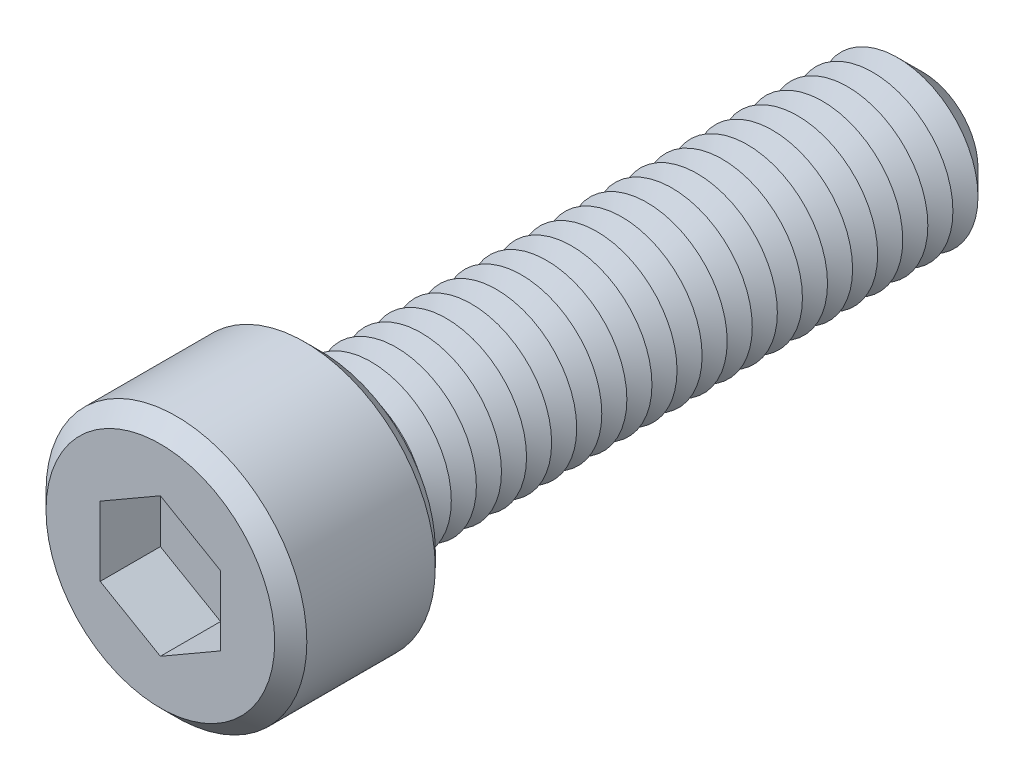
ISO-10303-21;
HEADER;
FILE_DESCRIPTION(('STEP AP214'),'2;1');
FILE_NAME('part.step','',(''),(''),'','','');
FILE_SCHEMA(('AUTOMOTIVE_DESIGN { 1 0 10303 214 1 1 1 1 }'));
ENDSEC;
DATA;
#1=APPLICATION_CONTEXT('core data for automotive mechanical design processes');
#2=APPLICATION_PROTOCOL_DEFINITION('international standard','automotive_design',2000,#1);
#3=PRODUCT_CONTEXT('',#1,'mechanical');
#4=PRODUCT('Part','Part','',(#3));
#5=PRODUCT_RELATED_PRODUCT_CATEGORY('part','',(#4));
#6=PRODUCT_DEFINITION_FORMATION('','',#4);
#7=PRODUCT_DEFINITION_CONTEXT('part definition',#1,'design');
#8=PRODUCT_DEFINITION('design','',#6,#7);
#9=PRODUCT_DEFINITION_SHAPE('','',#8);
#10=(LENGTH_UNIT() NAMED_UNIT(*) SI_UNIT(.MILLI.,.METRE.));
#11=(NAMED_UNIT(*) PLANE_ANGLE_UNIT() SI_UNIT($,.RADIAN.));
#12=(NAMED_UNIT(*) SI_UNIT($,.STERADIAN.) SOLID_ANGLE_UNIT());
#13=UNCERTAINTY_MEASURE_WITH_UNIT(LENGTH_MEASURE(1.E-05),#10,'distance_accuracy_value','');
#14=(GEOMETRIC_REPRESENTATION_CONTEXT(3) GLOBAL_UNCERTAINTY_ASSIGNED_CONTEXT((#13)) GLOBAL_UNIT_ASSIGNED_CONTEXT((#10,
#11,#12)) REPRESENTATION_CONTEXT('',''));
#15=CARTESIAN_POINT('',(0.,0.,0.));
#16=DIRECTION('',(0.,0.,1.));
#17=DIRECTION('',(1.,0.,0.));
#18=AXIS2_PLACEMENT_3D('',#15,#16,#17);
#19=CARTESIAN_POINT('',(0.,0.,8.));
#20=DIRECTION('',(0.,0.,-1.));
#21=DIRECTION('',(-1.,0.,0.));
#22=AXIS2_PLACEMENT_3D('',#19,#20,#21);
#23=CYLINDRICAL_SURFACE('',#22,6.5);
#24=CARTESIAN_POINT('',(0.,0.,0.800000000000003));
#25=DIRECTION('',(0.,0.,1.));
#26=DIRECTION('',(1.,0.,0.));
#27=AXIS2_PLACEMENT_3D('',#24,#25,#26);
#28=CIRCLE('',#27,6.5);
#29=CARTESIAN_POINT('',(6.5,0.,0.800000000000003));
#30=VERTEX_POINT('',#29);
#31=EDGE_CURVE('E360',#30,#30,#28,.T.);
#32=ORIENTED_EDGE('',*,*,#31,.T.);
#33=EDGE_LOOP('',(#32));
#34=FACE_BOUND('',#33,.T.);
#35=CARTESIAN_POINT('',(0.,0.,7.2));
#36=DIRECTION('',(0.,0.,1.));
#37=DIRECTION('',(1.,0.,0.));
#38=AXIS2_PLACEMENT_3D('',#35,#36,#37);
#39=CIRCLE('',#38,6.5);
#40=CARTESIAN_POINT('',(6.5,0.,7.2));
#41=VERTEX_POINT('',#40);
#42=EDGE_CURVE('E356',#41,#41,#39,.F.);
#43=ORIENTED_EDGE('',*,*,#42,.T.);
#44=EDGE_LOOP('',(#43));
#45=FACE_BOUND('',#44,.T.);
#46=ADVANCED_FACE('F39',(#34,#45),#23,.T.);
#47=CARTESIAN_POINT('',(0.,0.,8.));
#48=DIRECTION('',(0.,0.,1.));
#49=DIRECTION('',(1.,0.,0.));
#50=AXIS2_PLACEMENT_3D('',#47,#48,#49);
#51=PLANE('',#50);
#52=CARTESIAN_POINT('',(0.,0.,8.));
#53=DIRECTION('',(0.,0.,1.));
#54=DIRECTION('',(1.,0.,0.));
#55=AXIS2_PLACEMENT_3D('',#52,#53,#54);
#56=CIRCLE('',#55,5.70000000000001);
#57=CARTESIAN_POINT('',(5.70000000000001,0.,8.));
#58=VERTEX_POINT('',#57);
#59=EDGE_CURVE('E11',#58,#58,#56,.T.);
#60=ORIENTED_EDGE('',*,*,#59,.T.);
#61=EDGE_LOOP('',(#60));
#62=FACE_BOUND('',#61,.T.);
#63=DIRECTION('',(-0.866025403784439,0.5,0.));
#64=VECTOR('',#63,1.);
#65=CARTESIAN_POINT('',(3.,1.73205080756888,8.));
#66=LINE('',#65,#64);
#67=CARTESIAN_POINT('',(3.,1.73205080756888,8.));
#68=VERTEX_POINT('',#67);
#69=CARTESIAN_POINT('',(0.,3.46410161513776,8.));
#70=VERTEX_POINT('',#69);
#71=EDGE_CURVE('E55',#68,#70,#66,.T.);
#72=ORIENTED_EDGE('',*,*,#71,.F.);
#73=DIRECTION('',(0.,1.,0.));
#74=VECTOR('',#73,1.);
#75=CARTESIAN_POINT('',(3.,-1.73205080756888,8.));
#76=LINE('',#75,#74);
#77=CARTESIAN_POINT('',(3.,-1.73205080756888,8.));
#78=VERTEX_POINT('',#77);
#79=EDGE_CURVE('E151',#78,#68,#76,.T.);
#80=ORIENTED_EDGE('',*,*,#79,.F.);
#81=DIRECTION('',(0.866025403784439,0.5,0.));
#82=VECTOR('',#81,1.);
#83=CARTESIAN_POINT('',(0.,-3.46410161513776,8.));
#84=LINE('',#83,#82);
#85=CARTESIAN_POINT('',(0.,-3.46410161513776,8.));
#86=VERTEX_POINT('',#85);
#87=EDGE_CURVE('E148',#86,#78,#84,.T.);
#88=ORIENTED_EDGE('',*,*,#87,.F.);
#89=DIRECTION('',(0.866025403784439,-0.5,0.));
#90=VECTOR('',#89,1.);
#91=CARTESIAN_POINT('',(-3.,-1.73205080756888,8.));
#92=LINE('',#91,#90);
#93=CARTESIAN_POINT('',(-3.,-1.73205080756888,8.));
#94=VERTEX_POINT('',#93);
#95=EDGE_CURVE('E103',#94,#86,#92,.T.);
#96=ORIENTED_EDGE('',*,*,#95,.F.);
#97=DIRECTION('',(0.,-1.,0.));
#98=VECTOR('',#97,1.);
#99=CARTESIAN_POINT('',(-3.,1.73205080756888,8.));
#100=LINE('',#99,#98);
#101=CARTESIAN_POINT('',(-3.,1.73205080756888,8.));
#102=VERTEX_POINT('',#101);
#103=EDGE_CURVE('E142',#102,#94,#100,.T.);
#104=ORIENTED_EDGE('',*,*,#103,.F.);
#105=DIRECTION('',(-0.866025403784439,-0.5,0.));
#106=VECTOR('',#105,1.);
#107=CARTESIAN_POINT('',(0.,3.46410161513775,8.));
#108=LINE('',#107,#106);
#109=EDGE_CURVE('E137',#70,#102,#108,.T.);
#110=ORIENTED_EDGE('',*,*,#109,.F.);
#111=EDGE_LOOP('',(#72,#80,#88,#96,#104,#110));
#112=FACE_BOUND('',#111,.T.);
#113=ADVANCED_FACE('F379',(#62,#112),#51,.T.);
#114=CARTESIAN_POINT('',(0.,0.,0.));
#115=DIRECTION('',(0.,0.,1.));
#116=DIRECTION('',(1.,0.,0.));
#117=AXIS2_PLACEMENT_3D('',#114,#115,#116);
#118=PLANE('',#117);
#119=CARTESIAN_POINT('',(0.,0.,0.));
#120=DIRECTION('',(0.,0.,1.));
#121=DIRECTION('',(1.,0.,0.));
#122=AXIS2_PLACEMENT_3D('',#119,#120,#121);
#123=CIRCLE('',#122,5.69999999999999);
#124=CARTESIAN_POINT('',(5.69999999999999,0.,0.));
#125=VERTEX_POINT('',#124);
#126=EDGE_CURVE('E48',#125,#125,#123,.F.);
#127=ORIENTED_EDGE('',*,*,#126,.T.);
#128=EDGE_LOOP('',(#127));
#129=FACE_BOUND('',#128,.T.);
#130=CARTESIAN_POINT('',(0.,0.,0.));
#131=DIRECTION('',(0.,0.,1.));
#132=DIRECTION('',(1.,0.,0.));
#133=AXIS2_PLACEMENT_3D('',#130,#131,#132);
#134=CIRCLE('',#133,4.);
#135=CARTESIAN_POINT('',(4.,0.,0.));
#136=VERTEX_POINT('',#135);
#137=EDGE_CURVE('E348',#136,#136,#134,.T.);
#138=ORIENTED_EDGE('',*,*,#137,.T.);
#139=EDGE_LOOP('',(#138));
#140=FACE_BOUND('',#139,.T.);
#141=ADVANCED_FACE('F368',(#129,#140),#118,.F.);
#142=CARTESIAN_POINT('',(0.,0.,0.));
#143=DIRECTION('',(0.,0.,1.));
#144=DIRECTION('',(1.,0.,0.));
#145=AXIS2_PLACEMENT_3D('',#142,#143,#144);
#146=CONICAL_SURFACE('',#145,4.,1.0471975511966);
#147=CARTESIAN_POINT('',(0.,0.,-0.625000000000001));
#148=DIRECTION('',(0.,0.,1.));
#149=DIRECTION('',(1.,0.,0.));
#150=AXIS2_PLACEMENT_3D('',#147,#148,#149);
#151=CIRCLE('',#150,2.91746824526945);
#152=CARTESIAN_POINT('',(2.91746824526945,0.,-0.625000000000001));
#153=VERTEX_POINT('',#152);
#154=EDGE_CURVE('E344',#153,#153,#151,.T.);
#155=ORIENTED_EDGE('',*,*,#154,.T.);
#156=EDGE_LOOP('',(#155));
#157=FACE_BOUND('',#156,.T.);
#158=ORIENTED_EDGE('',*,*,#137,.F.);
#159=EDGE_LOOP('',(#158));
#160=FACE_BOUND('',#159,.T.);
#161=ADVANCED_FACE('F612',(#157,#160),#146,.T.);
#162=CARTESIAN_POINT('',(0.,0.,-0.625000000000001));
#163=DIRECTION('',(0.,0.,-1.));
#164=DIRECTION('',(-1.,0.,0.));
#165=AXIS2_PLACEMENT_3D('',#162,#163,#164);
#166=CONICAL_SURFACE('',#165,2.91746824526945,1.0471975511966);
#167=CARTESIAN_POINT('',(0.,0.,-1.25));
#168=DIRECTION('',(0.,0.,1.));
#169=DIRECTION('',(1.,0.,0.));
#170=AXIS2_PLACEMENT_3D('',#167,#168,#169);
#171=CIRCLE('',#170,4.);
#172=CARTESIAN_POINT('',(4.,0.,-1.25));
#173=VERTEX_POINT('',#172);
#174=EDGE_CURVE('E340',#173,#173,#171,.T.);
#175=ORIENTED_EDGE('',*,*,#174,.T.);
#176=EDGE_LOOP('',(#175));
#177=FACE_BOUND('',#176,.T.);
#178=ORIENTED_EDGE('',*,*,#154,.F.);
#179=EDGE_LOOP('',(#178));
#180=FACE_BOUND('',#179,.T.);
#181=ADVANCED_FACE('F608',(#177,#180),#166,.T.);
#182=CARTESIAN_POINT('',(0.,0.,-1.25));
#183=DIRECTION('',(0.,0.,1.));
#184=DIRECTION('',(1.,0.,0.));
#185=AXIS2_PLACEMENT_3D('',#182,#183,#184);
#186=CONICAL_SURFACE('',#185,4.,1.0471975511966);
#187=CARTESIAN_POINT('',(0.,0.,-1.875));
#188=DIRECTION('',(0.,0.,1.));
#189=DIRECTION('',(1.,0.,0.));
#190=AXIS2_PLACEMENT_3D('',#187,#188,#189);
#191=CIRCLE('',#190,2.91746824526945);
#192=CARTESIAN_POINT('',(2.91746824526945,0.,-1.875));
#193=VERTEX_POINT('',#192);
#194=EDGE_CURVE('E336',#193,#193,#191,.T.);
#195=ORIENTED_EDGE('',*,*,#194,.T.);
#196=EDGE_LOOP('',(#195));
#197=FACE_BOUND('',#196,.T.);
#198=ORIENTED_EDGE('',*,*,#174,.F.);
#199=EDGE_LOOP('',(#198));
#200=FACE_BOUND('',#199,.T.);
#201=ADVANCED_FACE('F604',(#197,#200),#186,.T.);
#202=CARTESIAN_POINT('',(0.,0.,-1.875));
#203=DIRECTION('',(0.,0.,-1.));
#204=DIRECTION('',(-1.,0.,0.));
#205=AXIS2_PLACEMENT_3D('',#202,#203,#204);
#206=CONICAL_SURFACE('',#205,2.91746824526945,1.0471975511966);
#207=CARTESIAN_POINT('',(0.,0.,-2.5));
#208=DIRECTION('',(0.,0.,1.));
#209=DIRECTION('',(1.,0.,0.));
#210=AXIS2_PLACEMENT_3D('',#207,#208,#209);
#211=CIRCLE('',#210,4.);
#212=CARTESIAN_POINT('',(4.,0.,-2.5));
#213=VERTEX_POINT('',#212);
#214=EDGE_CURVE('E332',#213,#213,#211,.T.);
#215=ORIENTED_EDGE('',*,*,#214,.T.);
#216=EDGE_LOOP('',(#215));
#217=FACE_BOUND('',#216,.T.);
#218=ORIENTED_EDGE('',*,*,#194,.F.);
#219=EDGE_LOOP('',(#218));
#220=FACE_BOUND('',#219,.T.);
#221=ADVANCED_FACE('F600',(#217,#220),#206,.T.);
#222=CARTESIAN_POINT('',(0.,0.,-2.5));
#223=DIRECTION('',(0.,0.,1.));
#224=DIRECTION('',(1.,0.,0.));
#225=AXIS2_PLACEMENT_3D('',#222,#223,#224);
#226=CONICAL_SURFACE('',#225,4.,1.0471975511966);
#227=CARTESIAN_POINT('',(0.,0.,-3.125));
#228=DIRECTION('',(0.,0.,1.));
#229=DIRECTION('',(1.,0.,0.));
#230=AXIS2_PLACEMENT_3D('',#227,#228,#229);
#231=CIRCLE('',#230,2.91746824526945);
#232=CARTESIAN_POINT('',(2.91746824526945,0.,-3.125));
#233=VERTEX_POINT('',#232);
#234=EDGE_CURVE('E328',#233,#233,#231,.T.);
#235=ORIENTED_EDGE('',*,*,#234,.T.);
#236=EDGE_LOOP('',(#235));
#237=FACE_BOUND('',#236,.T.);
#238=ORIENTED_EDGE('',*,*,#214,.F.);
#239=EDGE_LOOP('',(#238));
#240=FACE_BOUND('',#239,.T.);
#241=ADVANCED_FACE('F596',(#237,#240),#226,.T.);
#242=CARTESIAN_POINT('',(0.,0.,-3.125));
#243=DIRECTION('',(0.,0.,-1.));
#244=DIRECTION('',(-1.,0.,0.));
#245=AXIS2_PLACEMENT_3D('',#242,#243,#244);
#246=CONICAL_SURFACE('',#245,2.91746824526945,1.0471975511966);
#247=CARTESIAN_POINT('',(0.,0.,-3.75));
#248=DIRECTION('',(0.,0.,1.));
#249=DIRECTION('',(1.,0.,0.));
#250=AXIS2_PLACEMENT_3D('',#247,#248,#249);
#251=CIRCLE('',#250,4.);
#252=CARTESIAN_POINT('',(4.,0.,-3.75));
#253=VERTEX_POINT('',#252);
#254=EDGE_CURVE('E324',#253,#253,#251,.T.);
#255=ORIENTED_EDGE('',*,*,#254,.T.);
#256=EDGE_LOOP('',(#255));
#257=FACE_BOUND('',#256,.T.);
#258=ORIENTED_EDGE('',*,*,#234,.F.);
#259=EDGE_LOOP('',(#258));
#260=FACE_BOUND('',#259,.T.);
#261=ADVANCED_FACE('F592',(#257,#260),#246,.T.);
#262=CARTESIAN_POINT('',(0.,0.,-3.75));
#263=DIRECTION('',(0.,0.,1.));
#264=DIRECTION('',(1.,0.,0.));
#265=AXIS2_PLACEMENT_3D('',#262,#263,#264);
#266=CONICAL_SURFACE('',#265,4.,1.0471975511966);
#267=CARTESIAN_POINT('',(0.,0.,-4.375));
#268=DIRECTION('',(0.,0.,1.));
#269=DIRECTION('',(1.,0.,0.));
#270=AXIS2_PLACEMENT_3D('',#267,#268,#269);
#271=CIRCLE('',#270,2.91746824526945);
#272=CARTESIAN_POINT('',(2.91746824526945,0.,-4.375));
#273=VERTEX_POINT('',#272);
#274=EDGE_CURVE('E320',#273,#273,#271,.T.);
#275=ORIENTED_EDGE('',*,*,#274,.T.);
#276=EDGE_LOOP('',(#275));
#277=FACE_BOUND('',#276,.T.);
#278=ORIENTED_EDGE('',*,*,#254,.F.);
#279=EDGE_LOOP('',(#278));
#280=FACE_BOUND('',#279,.T.);
#281=ADVANCED_FACE('F588',(#277,#280),#266,.T.);
#282=CARTESIAN_POINT('',(0.,0.,-4.375));
#283=DIRECTION('',(0.,0.,-1.));
#284=DIRECTION('',(-1.,0.,0.));
#285=AXIS2_PLACEMENT_3D('',#282,#283,#284);
#286=CONICAL_SURFACE('',#285,2.91746824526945,1.0471975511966);
#287=CARTESIAN_POINT('',(0.,0.,-5.));
#288=DIRECTION('',(0.,0.,1.));
#289=DIRECTION('',(1.,0.,0.));
#290=AXIS2_PLACEMENT_3D('',#287,#288,#289);
#291=CIRCLE('',#290,4.);
#292=CARTESIAN_POINT('',(4.,0.,-5.));
#293=VERTEX_POINT('',#292);
#294=EDGE_CURVE('E316',#293,#293,#291,.T.);
#295=ORIENTED_EDGE('',*,*,#294,.T.);
#296=EDGE_LOOP('',(#295));
#297=FACE_BOUND('',#296,.T.);
#298=ORIENTED_EDGE('',*,*,#274,.F.);
#299=EDGE_LOOP('',(#298));
#300=FACE_BOUND('',#299,.T.);
#301=ADVANCED_FACE('F584',(#297,#300),#286,.T.);
#302=CARTESIAN_POINT('',(0.,0.,-5.));
#303=DIRECTION('',(0.,0.,1.));
#304=DIRECTION('',(1.,0.,0.));
#305=AXIS2_PLACEMENT_3D('',#302,#303,#304);
#306=CONICAL_SURFACE('',#305,4.,1.0471975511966);
#307=CARTESIAN_POINT('',(0.,0.,-5.625));
#308=DIRECTION('',(0.,0.,1.));
#309=DIRECTION('',(1.,0.,0.));
#310=AXIS2_PLACEMENT_3D('',#307,#308,#309);
#311=CIRCLE('',#310,2.91746824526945);
#312=CARTESIAN_POINT('',(2.91746824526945,0.,-5.625));
#313=VERTEX_POINT('',#312);
#314=EDGE_CURVE('E312',#313,#313,#311,.T.);
#315=ORIENTED_EDGE('',*,*,#314,.T.);
#316=EDGE_LOOP('',(#315));
#317=FACE_BOUND('',#316,.T.);
#318=ORIENTED_EDGE('',*,*,#294,.F.);
#319=EDGE_LOOP('',(#318));
#320=FACE_BOUND('',#319,.T.);
#321=ADVANCED_FACE('F580',(#317,#320),#306,.T.);
#322=CARTESIAN_POINT('',(0.,0.,-5.625));
#323=DIRECTION('',(0.,0.,-1.));
#324=DIRECTION('',(-1.,0.,0.));
#325=AXIS2_PLACEMENT_3D('',#322,#323,#324);
#326=CONICAL_SURFACE('',#325,2.91746824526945,1.0471975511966);
#327=CARTESIAN_POINT('',(0.,0.,-6.25));
#328=DIRECTION('',(0.,0.,1.));
#329=DIRECTION('',(1.,0.,0.));
#330=AXIS2_PLACEMENT_3D('',#327,#328,#329);
#331=CIRCLE('',#330,4.);
#332=CARTESIAN_POINT('',(4.,0.,-6.25));
#333=VERTEX_POINT('',#332);
#334=EDGE_CURVE('E308',#333,#333,#331,.T.);
#335=ORIENTED_EDGE('',*,*,#334,.T.);
#336=EDGE_LOOP('',(#335));
#337=FACE_BOUND('',#336,.T.);
#338=ORIENTED_EDGE('',*,*,#314,.F.);
#339=EDGE_LOOP('',(#338));
#340=FACE_BOUND('',#339,.T.);
#341=ADVANCED_FACE('F576',(#337,#340),#326,.T.);
#342=CARTESIAN_POINT('',(0.,0.,-6.25));
#343=DIRECTION('',(0.,0.,1.));
#344=DIRECTION('',(1.,0.,0.));
#345=AXIS2_PLACEMENT_3D('',#342,#343,#344);
#346=CONICAL_SURFACE('',#345,4.,1.0471975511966);
#347=CARTESIAN_POINT('',(0.,0.,-6.875));
#348=DIRECTION('',(0.,0.,1.));
#349=DIRECTION('',(1.,0.,0.));
#350=AXIS2_PLACEMENT_3D('',#347,#348,#349);
#351=CIRCLE('',#350,2.91746824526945);
#352=CARTESIAN_POINT('',(2.91746824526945,0.,-6.875));
#353=VERTEX_POINT('',#352);
#354=EDGE_CURVE('E304',#353,#353,#351,.T.);
#355=ORIENTED_EDGE('',*,*,#354,.T.);
#356=EDGE_LOOP('',(#355));
#357=FACE_BOUND('',#356,.T.);
#358=ORIENTED_EDGE('',*,*,#334,.F.);
#359=EDGE_LOOP('',(#358));
#360=FACE_BOUND('',#359,.T.);
#361=ADVANCED_FACE('F572',(#357,#360),#346,.T.);
#362=CARTESIAN_POINT('',(0.,0.,-6.875));
#363=DIRECTION('',(0.,0.,-1.));
#364=DIRECTION('',(-1.,0.,0.));
#365=AXIS2_PLACEMENT_3D('',#362,#363,#364);
#366=CONICAL_SURFACE('',#365,2.91746824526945,1.0471975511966);
#367=CARTESIAN_POINT('',(0.,0.,-7.5));
#368=DIRECTION('',(0.,0.,1.));
#369=DIRECTION('',(1.,0.,0.));
#370=AXIS2_PLACEMENT_3D('',#367,#368,#369);
#371=CIRCLE('',#370,4.);
#372=CARTESIAN_POINT('',(4.,0.,-7.5));
#373=VERTEX_POINT('',#372);
#374=EDGE_CURVE('E300',#373,#373,#371,.T.);
#375=ORIENTED_EDGE('',*,*,#374,.T.);
#376=EDGE_LOOP('',(#375));
#377=FACE_BOUND('',#376,.T.);
#378=ORIENTED_EDGE('',*,*,#354,.F.);
#379=EDGE_LOOP('',(#378));
#380=FACE_BOUND('',#379,.T.);
#381=ADVANCED_FACE('F568',(#377,#380),#366,.T.);
#382=CARTESIAN_POINT('',(0.,0.,-7.5));
#383=DIRECTION('',(0.,0.,1.));
#384=DIRECTION('',(1.,0.,0.));
#385=AXIS2_PLACEMENT_3D('',#382,#383,#384);
#386=CONICAL_SURFACE('',#385,4.,1.0471975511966);
#387=CARTESIAN_POINT('',(0.,0.,-8.125));
#388=DIRECTION('',(0.,0.,1.));
#389=DIRECTION('',(1.,0.,0.));
#390=AXIS2_PLACEMENT_3D('',#387,#388,#389);
#391=CIRCLE('',#390,2.91746824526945);
#392=CARTESIAN_POINT('',(2.91746824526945,0.,-8.125));
#393=VERTEX_POINT('',#392);
#394=EDGE_CURVE('E296',#393,#393,#391,.T.);
#395=ORIENTED_EDGE('',*,*,#394,.T.);
#396=EDGE_LOOP('',(#395));
#397=FACE_BOUND('',#396,.T.);
#398=ORIENTED_EDGE('',*,*,#374,.F.);
#399=EDGE_LOOP('',(#398));
#400=FACE_BOUND('',#399,.T.);
#401=ADVANCED_FACE('F564',(#397,#400),#386,.T.);
#402=CARTESIAN_POINT('',(0.,0.,-8.125));
#403=DIRECTION('',(0.,0.,-1.));
#404=DIRECTION('',(-1.,0.,0.));
#405=AXIS2_PLACEMENT_3D('',#402,#403,#404);
#406=CONICAL_SURFACE('',#405,2.91746824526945,1.0471975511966);
#407=CARTESIAN_POINT('',(0.,0.,-8.75));
#408=DIRECTION('',(0.,0.,1.));
#409=DIRECTION('',(1.,0.,0.));
#410=AXIS2_PLACEMENT_3D('',#407,#408,#409);
#411=CIRCLE('',#410,4.);
#412=CARTESIAN_POINT('',(4.,0.,-8.75));
#413=VERTEX_POINT('',#412);
#414=EDGE_CURVE('E292',#413,#413,#411,.T.);
#415=ORIENTED_EDGE('',*,*,#414,.T.);
#416=EDGE_LOOP('',(#415));
#417=FACE_BOUND('',#416,.T.);
#418=ORIENTED_EDGE('',*,*,#394,.F.);
#419=EDGE_LOOP('',(#418));
#420=FACE_BOUND('',#419,.T.);
#421=ADVANCED_FACE('F560',(#417,#420),#406,.T.);
#422=CARTESIAN_POINT('',(0.,0.,-8.75));
#423=DIRECTION('',(0.,0.,1.));
#424=DIRECTION('',(1.,0.,0.));
#425=AXIS2_PLACEMENT_3D('',#422,#423,#424);
#426=CONICAL_SURFACE('',#425,4.,1.0471975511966);
#427=CARTESIAN_POINT('',(0.,0.,-9.375));
#428=DIRECTION('',(0.,0.,1.));
#429=DIRECTION('',(1.,0.,0.));
#430=AXIS2_PLACEMENT_3D('',#427,#428,#429);
#431=CIRCLE('',#430,2.91746824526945);
#432=CARTESIAN_POINT('',(2.91746824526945,0.,-9.375));
#433=VERTEX_POINT('',#432);
#434=EDGE_CURVE('E289',#433,#433,#431,.T.);
#435=ORIENTED_EDGE('',*,*,#434,.T.);
#436=EDGE_LOOP('',(#435));
#437=FACE_BOUND('',#436,.T.);
#438=ORIENTED_EDGE('',*,*,#414,.F.);
#439=EDGE_LOOP('',(#438));
#440=FACE_BOUND('',#439,.T.);
#441=ADVANCED_FACE('F556',(#437,#440),#426,.T.);
#442=CARTESIAN_POINT('',(0.,0.,-9.375));
#443=DIRECTION('',(0.,0.,-1.));
#444=DIRECTION('',(-1.,0.,0.));
#445=AXIS2_PLACEMENT_3D('',#442,#443,#444);
#446=CONICAL_SURFACE('',#445,2.91746824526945,1.0471975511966);
#447=CARTESIAN_POINT('',(0.,0.,-10.));
#448=DIRECTION('',(0.,0.,1.));
#449=DIRECTION('',(1.,0.,0.));
#450=AXIS2_PLACEMENT_3D('',#447,#448,#449);
#451=CIRCLE('',#450,4.);
#452=CARTESIAN_POINT('',(4.,0.,-10.));
#453=VERTEX_POINT('',#452);
#454=EDGE_CURVE('E285',#453,#453,#451,.T.);
#455=ORIENTED_EDGE('',*,*,#454,.T.);
#456=EDGE_LOOP('',(#455));
#457=FACE_BOUND('',#456,.T.);
#458=ORIENTED_EDGE('',*,*,#434,.F.);
#459=EDGE_LOOP('',(#458));
#460=FACE_BOUND('',#459,.T.);
#461=ADVANCED_FACE('F552',(#457,#460),#446,.T.);
#462=CARTESIAN_POINT('',(0.,0.,-10.));
#463=DIRECTION('',(0.,0.,1.));
#464=DIRECTION('',(1.,0.,0.));
#465=AXIS2_PLACEMENT_3D('',#462,#463,#464);
#466=CONICAL_SURFACE('',#465,4.,1.0471975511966);
#467=CARTESIAN_POINT('',(0.,0.,-10.625));
#468=DIRECTION('',(0.,0.,1.));
#469=DIRECTION('',(1.,0.,0.));
#470=AXIS2_PLACEMENT_3D('',#467,#468,#469);
#471=CIRCLE('',#470,2.91746824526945);
#472=CARTESIAN_POINT('',(2.91746824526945,0.,-10.625));
#473=VERTEX_POINT('',#472);
#474=EDGE_CURVE('E281',#473,#473,#471,.T.);
#475=ORIENTED_EDGE('',*,*,#474,.T.);
#476=EDGE_LOOP('',(#475));
#477=FACE_BOUND('',#476,.T.);
#478=ORIENTED_EDGE('',*,*,#454,.F.);
#479=EDGE_LOOP('',(#478));
#480=FACE_BOUND('',#479,.T.);
#481=ADVANCED_FACE('F548',(#477,#480),#466,.T.);
#482=CARTESIAN_POINT('',(0.,0.,-10.625));
#483=DIRECTION('',(0.,0.,-1.));
#484=DIRECTION('',(-1.,0.,0.));
#485=AXIS2_PLACEMENT_3D('',#482,#483,#484);
#486=CONICAL_SURFACE('',#485,2.91746824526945,1.0471975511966);
#487=CARTESIAN_POINT('',(0.,0.,-11.25));
#488=DIRECTION('',(0.,0.,1.));
#489=DIRECTION('',(1.,0.,0.));
#490=AXIS2_PLACEMENT_3D('',#487,#488,#489);
#491=CIRCLE('',#490,4.);
#492=CARTESIAN_POINT('',(4.,0.,-11.25));
#493=VERTEX_POINT('',#492);
#494=EDGE_CURVE('E277',#493,#493,#491,.T.);
#495=ORIENTED_EDGE('',*,*,#494,.T.);
#496=EDGE_LOOP('',(#495));
#497=FACE_BOUND('',#496,.T.);
#498=ORIENTED_EDGE('',*,*,#474,.F.);
#499=EDGE_LOOP('',(#498));
#500=FACE_BOUND('',#499,.T.);
#501=ADVANCED_FACE('F544',(#497,#500),#486,.T.);
#502=CARTESIAN_POINT('',(0.,0.,-11.25));
#503=DIRECTION('',(0.,0.,1.));
#504=DIRECTION('',(1.,0.,0.));
#505=AXIS2_PLACEMENT_3D('',#502,#503,#504);
#506=CONICAL_SURFACE('',#505,4.,1.0471975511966);
#507=CARTESIAN_POINT('',(0.,0.,-11.875));
#508=DIRECTION('',(0.,0.,1.));
#509=DIRECTION('',(1.,0.,0.));
#510=AXIS2_PLACEMENT_3D('',#507,#508,#509);
#511=CIRCLE('',#510,2.91746824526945);
#512=CARTESIAN_POINT('',(2.91746824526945,0.,-11.875));
#513=VERTEX_POINT('',#512);
#514=EDGE_CURVE('E273',#513,#513,#511,.T.);
#515=ORIENTED_EDGE('',*,*,#514,.T.);
#516=EDGE_LOOP('',(#515));
#517=FACE_BOUND('',#516,.T.);
#518=ORIENTED_EDGE('',*,*,#494,.F.);
#519=EDGE_LOOP('',(#518));
#520=FACE_BOUND('',#519,.T.);
#521=ADVANCED_FACE('F540',(#517,#520),#506,.T.);
#522=CARTESIAN_POINT('',(0.,0.,-11.875));
#523=DIRECTION('',(0.,0.,-1.));
#524=DIRECTION('',(-1.,0.,0.));
#525=AXIS2_PLACEMENT_3D('',#522,#523,#524);
#526=CONICAL_SURFACE('',#525,2.91746824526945,1.0471975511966);
#527=CARTESIAN_POINT('',(0.,0.,-12.5));
#528=DIRECTION('',(0.,0.,1.));
#529=DIRECTION('',(1.,0.,0.));
#530=AXIS2_PLACEMENT_3D('',#527,#528,#529);
#531=CIRCLE('',#530,4.);
#532=CARTESIAN_POINT('',(4.,0.,-12.5));
#533=VERTEX_POINT('',#532);
#534=EDGE_CURVE('E269',#533,#533,#531,.T.);
#535=ORIENTED_EDGE('',*,*,#534,.T.);
#536=EDGE_LOOP('',(#535));
#537=FACE_BOUND('',#536,.T.);
#538=ORIENTED_EDGE('',*,*,#514,.F.);
#539=EDGE_LOOP('',(#538));
#540=FACE_BOUND('',#539,.T.);
#541=ADVANCED_FACE('F536',(#537,#540),#526,.T.);
#542=CARTESIAN_POINT('',(0.,0.,-12.5));
#543=DIRECTION('',(0.,0.,1.));
#544=DIRECTION('',(1.,0.,0.));
#545=AXIS2_PLACEMENT_3D('',#542,#543,#544);
#546=CONICAL_SURFACE('',#545,4.,1.0471975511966);
#547=CARTESIAN_POINT('',(0.,0.,-13.125));
#548=DIRECTION('',(0.,0.,1.));
#549=DIRECTION('',(1.,0.,0.));
#550=AXIS2_PLACEMENT_3D('',#547,#548,#549);
#551=CIRCLE('',#550,2.91746824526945);
#552=CARTESIAN_POINT('',(2.91746824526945,0.,-13.125));
#553=VERTEX_POINT('',#552);
#554=EDGE_CURVE('E265',#553,#553,#551,.T.);
#555=ORIENTED_EDGE('',*,*,#554,.T.);
#556=EDGE_LOOP('',(#555));
#557=FACE_BOUND('',#556,.T.);
#558=ORIENTED_EDGE('',*,*,#534,.F.);
#559=EDGE_LOOP('',(#558));
#560=FACE_BOUND('',#559,.T.);
#561=ADVANCED_FACE('F532',(#557,#560),#546,.T.);
#562=CARTESIAN_POINT('',(0.,0.,-13.125));
#563=DIRECTION('',(0.,0.,-1.));
#564=DIRECTION('',(-1.,0.,0.));
#565=AXIS2_PLACEMENT_3D('',#562,#563,#564);
#566=CONICAL_SURFACE('',#565,2.91746824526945,1.0471975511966);
#567=CARTESIAN_POINT('',(0.,0.,-13.75));
#568=DIRECTION('',(0.,0.,1.));
#569=DIRECTION('',(1.,0.,0.));
#570=AXIS2_PLACEMENT_3D('',#567,#568,#569);
#571=CIRCLE('',#570,4.);
#572=CARTESIAN_POINT('',(4.,0.,-13.75));
#573=VERTEX_POINT('',#572);
#574=EDGE_CURVE('E261',#573,#573,#571,.T.);
#575=ORIENTED_EDGE('',*,*,#574,.T.);
#576=EDGE_LOOP('',(#575));
#577=FACE_BOUND('',#576,.T.);
#578=ORIENTED_EDGE('',*,*,#554,.F.);
#579=EDGE_LOOP('',(#578));
#580=FACE_BOUND('',#579,.T.);
#581=ADVANCED_FACE('F528',(#577,#580),#566,.T.);
#582=CARTESIAN_POINT('',(0.,0.,-13.75));
#583=DIRECTION('',(0.,0.,1.));
#584=DIRECTION('',(1.,0.,0.));
#585=AXIS2_PLACEMENT_3D('',#582,#583,#584);
#586=CONICAL_SURFACE('',#585,4.,1.0471975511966);
#587=CARTESIAN_POINT('',(0.,0.,-14.375));
#588=DIRECTION('',(0.,0.,1.));
#589=DIRECTION('',(1.,0.,0.));
#590=AXIS2_PLACEMENT_3D('',#587,#588,#589);
#591=CIRCLE('',#590,2.91746824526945);
#592=CARTESIAN_POINT('',(2.91746824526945,0.,-14.375));
#593=VERTEX_POINT('',#592);
#594=EDGE_CURVE('E257',#593,#593,#591,.T.);
#595=ORIENTED_EDGE('',*,*,#594,.T.);
#596=EDGE_LOOP('',(#595));
#597=FACE_BOUND('',#596,.T.);
#598=ORIENTED_EDGE('',*,*,#574,.F.);
#599=EDGE_LOOP('',(#598));
#600=FACE_BOUND('',#599,.T.);
#601=ADVANCED_FACE('F524',(#597,#600),#586,.T.);
#602=CARTESIAN_POINT('',(0.,0.,-14.375));
#603=DIRECTION('',(0.,0.,-1.));
#604=DIRECTION('',(-1.,0.,0.));
#605=AXIS2_PLACEMENT_3D('',#602,#603,#604);
#606=CONICAL_SURFACE('',#605,2.91746824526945,1.0471975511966);
#607=CARTESIAN_POINT('',(0.,0.,-15.));
#608=DIRECTION('',(0.,0.,1.));
#609=DIRECTION('',(1.,0.,0.));
#610=AXIS2_PLACEMENT_3D('',#607,#608,#609);
#611=CIRCLE('',#610,4.);
#612=CARTESIAN_POINT('',(4.,0.,-15.));
#613=VERTEX_POINT('',#612);
#614=EDGE_CURVE('E253',#613,#613,#611,.T.);
#615=ORIENTED_EDGE('',*,*,#614,.T.);
#616=EDGE_LOOP('',(#615));
#617=FACE_BOUND('',#616,.T.);
#618=ORIENTED_EDGE('',*,*,#594,.F.);
#619=EDGE_LOOP('',(#618));
#620=FACE_BOUND('',#619,.T.);
#621=ADVANCED_FACE('F520',(#617,#620),#606,.T.);
#622=CARTESIAN_POINT('',(0.,0.,-15.));
#623=DIRECTION('',(0.,0.,1.));
#624=DIRECTION('',(1.,0.,0.));
#625=AXIS2_PLACEMENT_3D('',#622,#623,#624);
#626=CONICAL_SURFACE('',#625,4.,1.0471975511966);
#627=CARTESIAN_POINT('',(0.,0.,-15.625));
#628=DIRECTION('',(0.,0.,1.));
#629=DIRECTION('',(1.,0.,0.));
#630=AXIS2_PLACEMENT_3D('',#627,#628,#629);
#631=CIRCLE('',#630,2.91746824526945);
#632=CARTESIAN_POINT('',(2.91746824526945,0.,-15.625));
#633=VERTEX_POINT('',#632);
#634=EDGE_CURVE('E249',#633,#633,#631,.T.);
#635=ORIENTED_EDGE('',*,*,#634,.T.);
#636=EDGE_LOOP('',(#635));
#637=FACE_BOUND('',#636,.T.);
#638=ORIENTED_EDGE('',*,*,#614,.F.);
#639=EDGE_LOOP('',(#638));
#640=FACE_BOUND('',#639,.T.);
#641=ADVANCED_FACE('F516',(#637,#640),#626,.T.);
#642=CARTESIAN_POINT('',(0.,0.,-15.625));
#643=DIRECTION('',(0.,0.,-1.));
#644=DIRECTION('',(-1.,0.,0.));
#645=AXIS2_PLACEMENT_3D('',#642,#643,#644);
#646=CONICAL_SURFACE('',#645,2.91746824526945,1.0471975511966);
#647=CARTESIAN_POINT('',(0.,0.,-16.25));
#648=DIRECTION('',(0.,0.,1.));
#649=DIRECTION('',(1.,0.,0.));
#650=AXIS2_PLACEMENT_3D('',#647,#648,#649);
#651=CIRCLE('',#650,4.);
#652=CARTESIAN_POINT('',(4.,0.,-16.25));
#653=VERTEX_POINT('',#652);
#654=EDGE_CURVE('E245',#653,#653,#651,.T.);
#655=ORIENTED_EDGE('',*,*,#654,.T.);
#656=EDGE_LOOP('',(#655));
#657=FACE_BOUND('',#656,.T.);
#658=ORIENTED_EDGE('',*,*,#634,.F.);
#659=EDGE_LOOP('',(#658));
#660=FACE_BOUND('',#659,.T.);
#661=ADVANCED_FACE('F512',(#657,#660),#646,.T.);
#662=CARTESIAN_POINT('',(0.,0.,-16.25));
#663=DIRECTION('',(0.,0.,1.));
#664=DIRECTION('',(1.,0.,0.));
#665=AXIS2_PLACEMENT_3D('',#662,#663,#664);
#666=CONICAL_SURFACE('',#665,4.,1.0471975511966);
#667=CARTESIAN_POINT('',(0.,0.,-16.875));
#668=DIRECTION('',(0.,0.,1.));
#669=DIRECTION('',(1.,0.,0.));
#670=AXIS2_PLACEMENT_3D('',#667,#668,#669);
#671=CIRCLE('',#670,2.91746824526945);
#672=CARTESIAN_POINT('',(2.91746824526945,0.,-16.875));
#673=VERTEX_POINT('',#672);
#674=EDGE_CURVE('E241',#673,#673,#671,.T.);
#675=ORIENTED_EDGE('',*,*,#674,.T.);
#676=EDGE_LOOP('',(#675));
#677=FACE_BOUND('',#676,.T.);
#678=ORIENTED_EDGE('',*,*,#654,.F.);
#679=EDGE_LOOP('',(#678));
#680=FACE_BOUND('',#679,.T.);
#681=ADVANCED_FACE('F508',(#677,#680),#666,.T.);
#682=CARTESIAN_POINT('',(0.,0.,-16.875));
#683=DIRECTION('',(0.,0.,-1.));
#684=DIRECTION('',(-1.,0.,0.));
#685=AXIS2_PLACEMENT_3D('',#682,#683,#684);
#686=CONICAL_SURFACE('',#685,2.91746824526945,1.0471975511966);
#687=CARTESIAN_POINT('',(0.,0.,-17.5));
#688=DIRECTION('',(0.,0.,1.));
#689=DIRECTION('',(1.,0.,0.));
#690=AXIS2_PLACEMENT_3D('',#687,#688,#689);
#691=CIRCLE('',#690,4.);
#692=CARTESIAN_POINT('',(4.,0.,-17.5));
#693=VERTEX_POINT('',#692);
#694=EDGE_CURVE('E237',#693,#693,#691,.T.);
#695=ORIENTED_EDGE('',*,*,#694,.T.);
#696=EDGE_LOOP('',(#695));
#697=FACE_BOUND('',#696,.T.);
#698=ORIENTED_EDGE('',*,*,#674,.F.);
#699=EDGE_LOOP('',(#698));
#700=FACE_BOUND('',#699,.T.);
#701=ADVANCED_FACE('F504',(#697,#700),#686,.T.);
#702=CARTESIAN_POINT('',(0.,0.,-17.5));
#703=DIRECTION('',(0.,0.,1.));
#704=DIRECTION('',(1.,0.,0.));
#705=AXIS2_PLACEMENT_3D('',#702,#703,#704);
#706=CONICAL_SURFACE('',#705,4.,1.0471975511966);
#707=CARTESIAN_POINT('',(0.,0.,-18.125));
#708=DIRECTION('',(0.,0.,1.));
#709=DIRECTION('',(1.,0.,0.));
#710=AXIS2_PLACEMENT_3D('',#707,#708,#709);
#711=CIRCLE('',#710,2.91746824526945);
#712=CARTESIAN_POINT('',(2.91746824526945,0.,-18.125));
#713=VERTEX_POINT('',#712);
#714=EDGE_CURVE('E233',#713,#713,#711,.T.);
#715=ORIENTED_EDGE('',*,*,#714,.T.);
#716=EDGE_LOOP('',(#715));
#717=FACE_BOUND('',#716,.T.);
#718=ORIENTED_EDGE('',*,*,#694,.F.);
#719=EDGE_LOOP('',(#718));
#720=FACE_BOUND('',#719,.T.);
#721=ADVANCED_FACE('F500',(#717,#720),#706,.T.);
#722=CARTESIAN_POINT('',(0.,0.,-18.125));
#723=DIRECTION('',(0.,0.,-1.));
#724=DIRECTION('',(-1.,0.,0.));
#725=AXIS2_PLACEMENT_3D('',#722,#723,#724);
#726=CONICAL_SURFACE('',#725,2.91746824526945,1.0471975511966);
#727=CARTESIAN_POINT('',(0.,0.,-18.75));
#728=DIRECTION('',(0.,0.,1.));
#729=DIRECTION('',(1.,0.,0.));
#730=AXIS2_PLACEMENT_3D('',#727,#728,#729);
#731=CIRCLE('',#730,4.);
#732=CARTESIAN_POINT('',(4.,0.,-18.75));
#733=VERTEX_POINT('',#732);
#734=EDGE_CURVE('E229',#733,#733,#731,.T.);
#735=ORIENTED_EDGE('',*,*,#734,.T.);
#736=EDGE_LOOP('',(#735));
#737=FACE_BOUND('',#736,.T.);
#738=ORIENTED_EDGE('',*,*,#714,.F.);
#739=EDGE_LOOP('',(#738));
#740=FACE_BOUND('',#739,.T.);
#741=ADVANCED_FACE('F496',(#737,#740),#726,.T.);
#742=CARTESIAN_POINT('',(0.,0.,-18.75));
#743=DIRECTION('',(0.,0.,1.));
#744=DIRECTION('',(1.,0.,0.));
#745=AXIS2_PLACEMENT_3D('',#742,#743,#744);
#746=CONICAL_SURFACE('',#745,4.,1.0471975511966);
#747=CARTESIAN_POINT('',(0.,0.,-19.375));
#748=DIRECTION('',(0.,0.,1.));
#749=DIRECTION('',(1.,0.,0.));
#750=AXIS2_PLACEMENT_3D('',#747,#748,#749);
#751=CIRCLE('',#750,2.91746824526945);
#752=CARTESIAN_POINT('',(2.91746824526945,0.,-19.375));
#753=VERTEX_POINT('',#752);
#754=EDGE_CURVE('E225',#753,#753,#751,.T.);
#755=ORIENTED_EDGE('',*,*,#754,.T.);
#756=EDGE_LOOP('',(#755));
#757=FACE_BOUND('',#756,.T.);
#758=ORIENTED_EDGE('',*,*,#734,.F.);
#759=EDGE_LOOP('',(#758));
#760=FACE_BOUND('',#759,.T.);
#761=ADVANCED_FACE('F492',(#757,#760),#746,.T.);
#762=CARTESIAN_POINT('',(0.,0.,-19.375));
#763=DIRECTION('',(0.,0.,-1.));
#764=DIRECTION('',(-1.,0.,0.));
#765=AXIS2_PLACEMENT_3D('',#762,#763,#764);
#766=CONICAL_SURFACE('',#765,2.91746824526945,1.0471975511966);
#767=CARTESIAN_POINT('',(0.,0.,-20.));
#768=DIRECTION('',(0.,0.,1.));
#769=DIRECTION('',(1.,0.,0.));
#770=AXIS2_PLACEMENT_3D('',#767,#768,#769);
#771=CIRCLE('',#770,4.);
#772=CARTESIAN_POINT('',(4.,0.,-20.));
#773=VERTEX_POINT('',#772);
#774=EDGE_CURVE('E221',#773,#773,#771,.T.);
#775=ORIENTED_EDGE('',*,*,#774,.T.);
#776=EDGE_LOOP('',(#775));
#777=FACE_BOUND('',#776,.T.);
#778=ORIENTED_EDGE('',*,*,#754,.F.);
#779=EDGE_LOOP('',(#778));
#780=FACE_BOUND('',#779,.T.);
#781=ADVANCED_FACE('F488',(#777,#780),#766,.T.);
#782=CARTESIAN_POINT('',(0.,0.,-20.));
#783=DIRECTION('',(0.,0.,1.));
#784=DIRECTION('',(1.,0.,0.));
#785=AXIS2_PLACEMENT_3D('',#782,#783,#784);
#786=CONICAL_SURFACE('',#785,4.,1.0471975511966);
#787=CARTESIAN_POINT('',(0.,0.,-20.625));
#788=DIRECTION('',(0.,0.,1.));
#789=DIRECTION('',(1.,0.,0.));
#790=AXIS2_PLACEMENT_3D('',#787,#788,#789);
#791=CIRCLE('',#790,2.91746824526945);
#792=CARTESIAN_POINT('',(2.91746824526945,0.,-20.625));
#793=VERTEX_POINT('',#792);
#794=EDGE_CURVE('E217',#793,#793,#791,.T.);
#795=ORIENTED_EDGE('',*,*,#794,.T.);
#796=EDGE_LOOP('',(#795));
#797=FACE_BOUND('',#796,.T.);
#798=ORIENTED_EDGE('',*,*,#774,.F.);
#799=EDGE_LOOP('',(#798));
#800=FACE_BOUND('',#799,.T.);
#801=ADVANCED_FACE('F484',(#797,#800),#786,.T.);
#802=CARTESIAN_POINT('',(0.,0.,-20.625));
#803=DIRECTION('',(0.,0.,-1.));
#804=DIRECTION('',(-1.,0.,0.));
#805=AXIS2_PLACEMENT_3D('',#802,#803,#804);
#806=CONICAL_SURFACE('',#805,2.91746824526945,1.0471975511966);
#807=CARTESIAN_POINT('',(0.,0.,-21.25));
#808=DIRECTION('',(0.,0.,1.));
#809=DIRECTION('',(1.,0.,0.));
#810=AXIS2_PLACEMENT_3D('',#807,#808,#809);
#811=CIRCLE('',#810,4.);
#812=CARTESIAN_POINT('',(4.,0.,-21.25));
#813=VERTEX_POINT('',#812);
#814=EDGE_CURVE('E213',#813,#813,#811,.T.);
#815=ORIENTED_EDGE('',*,*,#814,.T.);
#816=EDGE_LOOP('',(#815));
#817=FACE_BOUND('',#816,.T.);
#818=ORIENTED_EDGE('',*,*,#794,.F.);
#819=EDGE_LOOP('',(#818));
#820=FACE_BOUND('',#819,.T.);
#821=ADVANCED_FACE('F480',(#817,#820),#806,.T.);
#822=CARTESIAN_POINT('',(0.,0.,-21.25));
#823=DIRECTION('',(0.,0.,1.));
#824=DIRECTION('',(1.,0.,0.));
#825=AXIS2_PLACEMENT_3D('',#822,#823,#824);
#826=CONICAL_SURFACE('',#825,4.,1.0471975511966);
#827=CARTESIAN_POINT('',(0.,0.,-21.875));
#828=DIRECTION('',(0.,0.,1.));
#829=DIRECTION('',(1.,0.,0.));
#830=AXIS2_PLACEMENT_3D('',#827,#828,#829);
#831=CIRCLE('',#830,2.91746824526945);
#832=CARTESIAN_POINT('',(2.91746824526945,0.,-21.875));
#833=VERTEX_POINT('',#832);
#834=EDGE_CURVE('E209',#833,#833,#831,.T.);
#835=ORIENTED_EDGE('',*,*,#834,.T.);
#836=EDGE_LOOP('',(#835));
#837=FACE_BOUND('',#836,.T.);
#838=ORIENTED_EDGE('',*,*,#814,.F.);
#839=EDGE_LOOP('',(#838));
#840=FACE_BOUND('',#839,.T.);
#841=ADVANCED_FACE('F476',(#837,#840),#826,.T.);
#842=CARTESIAN_POINT('',(0.,0.,-21.875));
#843=DIRECTION('',(0.,0.,-1.));
#844=DIRECTION('',(-1.,0.,0.));
#845=AXIS2_PLACEMENT_3D('',#842,#843,#844);
#846=CONICAL_SURFACE('',#845,2.91746824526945,1.0471975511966);
#847=CARTESIAN_POINT('',(0.,0.,-22.5));
#848=DIRECTION('',(0.,0.,1.));
#849=DIRECTION('',(1.,0.,0.));
#850=AXIS2_PLACEMENT_3D('',#847,#848,#849);
#851=CIRCLE('',#850,4.);
#852=CARTESIAN_POINT('',(4.,0.,-22.5));
#853=VERTEX_POINT('',#852);
#854=EDGE_CURVE('E205',#853,#853,#851,.T.);
#855=ORIENTED_EDGE('',*,*,#854,.T.);
#856=EDGE_LOOP('',(#855));
#857=FACE_BOUND('',#856,.T.);
#858=ORIENTED_EDGE('',*,*,#834,.F.);
#859=EDGE_LOOP('',(#858));
#860=FACE_BOUND('',#859,.T.);
#861=ADVANCED_FACE('F472',(#857,#860),#846,.T.);
#862=CARTESIAN_POINT('',(0.,0.,-22.5));
#863=DIRECTION('',(0.,0.,1.));
#864=DIRECTION('',(1.,0.,0.));
#865=AXIS2_PLACEMENT_3D('',#862,#863,#864);
#866=CONICAL_SURFACE('',#865,4.,1.0471975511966);
#867=CARTESIAN_POINT('',(0.,0.,-23.125));
#868=DIRECTION('',(0.,0.,1.));
#869=DIRECTION('',(1.,0.,0.));
#870=AXIS2_PLACEMENT_3D('',#867,#868,#869);
#871=CIRCLE('',#870,2.91746824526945);
#872=CARTESIAN_POINT('',(2.91746824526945,0.,-23.125));
#873=VERTEX_POINT('',#872);
#874=EDGE_CURVE('E201',#873,#873,#871,.T.);
#875=ORIENTED_EDGE('',*,*,#874,.T.);
#876=EDGE_LOOP('',(#875));
#877=FACE_BOUND('',#876,.T.);
#878=ORIENTED_EDGE('',*,*,#854,.F.);
#879=EDGE_LOOP('',(#878));
#880=FACE_BOUND('',#879,.T.);
#881=ADVANCED_FACE('F468',(#877,#880),#866,.T.);
#882=CARTESIAN_POINT('',(0.,0.,-23.125));
#883=DIRECTION('',(0.,0.,-1.));
#884=DIRECTION('',(-1.,0.,0.));
#885=AXIS2_PLACEMENT_3D('',#882,#883,#884);
#886=CONICAL_SURFACE('',#885,2.91746824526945,1.0471975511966);
#887=CARTESIAN_POINT('',(0.,0.,-23.75));
#888=DIRECTION('',(0.,0.,1.));
#889=DIRECTION('',(1.,0.,0.));
#890=AXIS2_PLACEMENT_3D('',#887,#888,#889);
#891=CIRCLE('',#890,4.);
#892=CARTESIAN_POINT('',(4.,0.,-23.75));
#893=VERTEX_POINT('',#892);
#894=EDGE_CURVE('E197',#893,#893,#891,.T.);
#895=ORIENTED_EDGE('',*,*,#894,.T.);
#896=EDGE_LOOP('',(#895));
#897=FACE_BOUND('',#896,.T.);
#898=ORIENTED_EDGE('',*,*,#874,.F.);
#899=EDGE_LOOP('',(#898));
#900=FACE_BOUND('',#899,.T.);
#901=ADVANCED_FACE('F464',(#897,#900),#886,.T.);
#902=CARTESIAN_POINT('',(0.,0.,-23.75));
#903=DIRECTION('',(0.,0.,1.));
#904=DIRECTION('',(1.,0.,0.));
#905=AXIS2_PLACEMENT_3D('',#902,#903,#904);
#906=CONICAL_SURFACE('',#905,4.,1.0471975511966);
#907=CARTESIAN_POINT('',(0.,0.,-24.375));
#908=DIRECTION('',(0.,0.,1.));
#909=DIRECTION('',(1.,0.,0.));
#910=AXIS2_PLACEMENT_3D('',#907,#908,#909);
#911=CIRCLE('',#910,2.91746824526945);
#912=CARTESIAN_POINT('',(2.91746824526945,0.,-24.375));
#913=VERTEX_POINT('',#912);
#914=EDGE_CURVE('E193',#913,#913,#911,.T.);
#915=ORIENTED_EDGE('',*,*,#914,.T.);
#916=EDGE_LOOP('',(#915));
#917=FACE_BOUND('',#916,.T.);
#918=ORIENTED_EDGE('',*,*,#894,.F.);
#919=EDGE_LOOP('',(#918));
#920=FACE_BOUND('',#919,.T.);
#921=ADVANCED_FACE('F460',(#917,#920),#906,.T.);
#922=CARTESIAN_POINT('',(0.,0.,-24.375));
#923=DIRECTION('',(0.,0.,-1.));
#924=DIRECTION('',(-1.,0.,0.));
#925=AXIS2_PLACEMENT_3D('',#922,#923,#924);
#926=CONICAL_SURFACE('',#925,2.91746824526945,1.0471975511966);
#927=CARTESIAN_POINT('',(0.,0.,-25.));
#928=DIRECTION('',(0.,0.,1.));
#929=DIRECTION('',(1.,0.,0.));
#930=AXIS2_PLACEMENT_3D('',#927,#928,#929);
#931=CIRCLE('',#930,4.);
#932=CARTESIAN_POINT('',(4.,0.,-25.));
#933=VERTEX_POINT('',#932);
#934=EDGE_CURVE('E189',#933,#933,#931,.T.);
#935=ORIENTED_EDGE('',*,*,#934,.T.);
#936=EDGE_LOOP('',(#935));
#937=FACE_BOUND('',#936,.T.);
#938=ORIENTED_EDGE('',*,*,#914,.F.);
#939=EDGE_LOOP('',(#938));
#940=FACE_BOUND('',#939,.T.);
#941=ADVANCED_FACE('F456',(#937,#940),#926,.T.);
#942=CARTESIAN_POINT('',(0.,0.,-25.));
#943=DIRECTION('',(0.,0.,1.));
#944=DIRECTION('',(1.,0.,0.));
#945=AXIS2_PLACEMENT_3D('',#942,#943,#944);
#946=CONICAL_SURFACE('',#945,4.,1.0471975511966);
#947=CARTESIAN_POINT('',(0.,0.,-25.625));
#948=DIRECTION('',(0.,0.,1.));
#949=DIRECTION('',(1.,0.,0.));
#950=AXIS2_PLACEMENT_3D('',#947,#948,#949);
#951=CIRCLE('',#950,2.91746824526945);
#952=CARTESIAN_POINT('',(2.91746824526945,0.,-25.625));
#953=VERTEX_POINT('',#952);
#954=EDGE_CURVE('E185',#953,#953,#951,.T.);
#955=ORIENTED_EDGE('',*,*,#954,.T.);
#956=EDGE_LOOP('',(#955));
#957=FACE_BOUND('',#956,.T.);
#958=ORIENTED_EDGE('',*,*,#934,.F.);
#959=EDGE_LOOP('',(#958));
#960=FACE_BOUND('',#959,.T.);
#961=ADVANCED_FACE('F452',(#957,#960),#946,.T.);
#962=CARTESIAN_POINT('',(0.,0.,-25.625));
#963=DIRECTION('',(0.,0.,-1.));
#964=DIRECTION('',(-1.,0.,0.));
#965=AXIS2_PLACEMENT_3D('',#962,#963,#964);
#966=CONICAL_SURFACE('',#965,2.91746824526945,1.0471975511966);
#967=CARTESIAN_POINT('',(0.,0.,-26.25));
#968=DIRECTION('',(0.,0.,1.));
#969=DIRECTION('',(1.,0.,0.));
#970=AXIS2_PLACEMENT_3D('',#967,#968,#969);
#971=CIRCLE('',#970,4.);
#972=CARTESIAN_POINT('',(4.,0.,-26.25));
#973=VERTEX_POINT('',#972);
#974=EDGE_CURVE('E181',#973,#973,#971,.T.);
#975=ORIENTED_EDGE('',*,*,#974,.T.);
#976=EDGE_LOOP('',(#975));
#977=FACE_BOUND('',#976,.T.);
#978=ORIENTED_EDGE('',*,*,#954,.F.);
#979=EDGE_LOOP('',(#978));
#980=FACE_BOUND('',#979,.T.);
#981=ADVANCED_FACE('F448',(#977,#980),#966,.T.);
#982=CARTESIAN_POINT('',(0.,0.,-26.25));
#983=DIRECTION('',(0.,0.,1.));
#984=DIRECTION('',(1.,0.,0.));
#985=AXIS2_PLACEMENT_3D('',#982,#983,#984);
#986=CONICAL_SURFACE('',#985,4.,1.0471975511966);
#987=CARTESIAN_POINT('',(0.,0.,-26.875));
#988=DIRECTION('',(0.,0.,1.));
#989=DIRECTION('',(1.,0.,0.));
#990=AXIS2_PLACEMENT_3D('',#987,#988,#989);
#991=CIRCLE('',#990,2.91746824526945);
#992=CARTESIAN_POINT('',(2.91746824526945,0.,-26.875));
#993=VERTEX_POINT('',#992);
#994=EDGE_CURVE('E177',#993,#993,#991,.T.);
#995=ORIENTED_EDGE('',*,*,#994,.T.);
#996=EDGE_LOOP('',(#995));
#997=FACE_BOUND('',#996,.T.);
#998=ORIENTED_EDGE('',*,*,#974,.F.);
#999=EDGE_LOOP('',(#998));
#1000=FACE_BOUND('',#999,.T.);
#1001=ADVANCED_FACE('F444',(#997,#1000),#986,.T.);
#1002=CARTESIAN_POINT('',(0.,0.,-26.875));
#1003=DIRECTION('',(0.,0.,-1.));
#1004=DIRECTION('',(-1.,0.,0.));
#1005=AXIS2_PLACEMENT_3D('',#1002,#1003,#1004);
#1006=CONICAL_SURFACE('',#1005,2.91746824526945,1.0471975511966);
#1007=CARTESIAN_POINT('',(0.,0.,-27.5));
#1008=DIRECTION('',(0.,0.,1.));
#1009=DIRECTION('',(1.,0.,0.));
#1010=AXIS2_PLACEMENT_3D('',#1007,#1008,#1009);
#1011=CIRCLE('',#1010,4.);
#1012=CARTESIAN_POINT('',(4.,0.,-27.5));
#1013=VERTEX_POINT('',#1012);
#1014=EDGE_CURVE('E173',#1013,#1013,#1011,.T.);
#1015=ORIENTED_EDGE('',*,*,#1014,.T.);
#1016=EDGE_LOOP('',(#1015));
#1017=FACE_BOUND('',#1016,.T.);
#1018=ORIENTED_EDGE('',*,*,#994,.F.);
#1019=EDGE_LOOP('',(#1018));
#1020=FACE_BOUND('',#1019,.T.);
#1021=ADVANCED_FACE('F440',(#1017,#1020),#1006,.T.);
#1022=CARTESIAN_POINT('',(0.,0.,-27.5));
#1023=DIRECTION('',(0.,0.,1.));
#1024=DIRECTION('',(1.,0.,0.));
#1025=AXIS2_PLACEMENT_3D('',#1022,#1023,#1024);
#1026=CONICAL_SURFACE('',#1025,4.,1.0471975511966);
#1027=CARTESIAN_POINT('',(0.,0.,-28.125));
#1028=DIRECTION('',(0.,0.,1.));
#1029=DIRECTION('',(1.,0.,0.));
#1030=AXIS2_PLACEMENT_3D('',#1027,#1028,#1029);
#1031=CIRCLE('',#1030,2.91746824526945);
#1032=CARTESIAN_POINT('',(2.91746824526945,0.,-28.125));
#1033=VERTEX_POINT('',#1032);
#1034=EDGE_CURVE('E169',#1033,#1033,#1031,.T.);
#1035=ORIENTED_EDGE('',*,*,#1034,.T.);
#1036=EDGE_LOOP('',(#1035));
#1037=FACE_BOUND('',#1036,.T.);
#1038=ORIENTED_EDGE('',*,*,#1014,.F.);
#1039=EDGE_LOOP('',(#1038));
#1040=FACE_BOUND('',#1039,.T.);
#1041=ADVANCED_FACE('F436',(#1037,#1040),#1026,.T.);
#1042=CARTESIAN_POINT('',(0.,0.,-28.125));
#1043=DIRECTION('',(0.,0.,-1.));
#1044=DIRECTION('',(-1.,0.,0.));
#1045=AXIS2_PLACEMENT_3D('',#1042,#1043,#1044);
#1046=CONICAL_SURFACE('',#1045,2.91746824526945,1.0471975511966);
#1047=CARTESIAN_POINT('',(0.,0.,-28.75));
#1048=DIRECTION('',(0.,0.,1.));
#1049=DIRECTION('',(1.,0.,0.));
#1050=AXIS2_PLACEMENT_3D('',#1047,#1048,#1049);
#1051=CIRCLE('',#1050,4.);
#1052=CARTESIAN_POINT('',(4.,0.,-28.75));
#1053=VERTEX_POINT('',#1052);
#1054=EDGE_CURVE('E156',#1053,#1053,#1051,.T.);
#1055=ORIENTED_EDGE('',*,*,#1054,.T.);
#1056=EDGE_LOOP('',(#1055));
#1057=FACE_BOUND('',#1056,.T.);
#1058=ORIENTED_EDGE('',*,*,#1034,.F.);
#1059=EDGE_LOOP('',(#1058));
#1060=FACE_BOUND('',#1059,.T.);
#1061=ADVANCED_FACE('F432',(#1057,#1060),#1046,.T.);
#1062=CARTESIAN_POINT('',(0.,0.,-30.));
#1063=DIRECTION('',(0.,0.,-1.));
#1064=DIRECTION('',(-1.,0.,0.));
#1065=AXIS2_PLACEMENT_3D('',#1062,#1063,#1064);
#1066=PLANE('',#1065);
#1067=CARTESIAN_POINT('',(0.,0.,-30.));
#1068=DIRECTION('',(0.,0.,-1.));
#1069=DIRECTION('',(-1.,0.,0.));
#1070=AXIS2_PLACEMENT_3D('',#1067,#1068,#1069);
#1071=CIRCLE('',#1070,0.9);
#1072=CARTESIAN_POINT('',(0.9,0.,-30.));
#1073=VERTEX_POINT('',#1072);
#1074=EDGE_CURVE('E138',#1073,#1073,#1071,.F.);
#1075=ORIENTED_EDGE('',*,*,#1074,.T.);
#1076=EDGE_LOOP('',(#1075));
#1077=FACE_BOUND('',#1076,.T.);
#1078=CARTESIAN_POINT('',(0.,0.,-30.));
#1079=DIRECTION('',(0.,0.,-1.));
#1080=DIRECTION('',(-1.,0.,0.));
#1081=AXIS2_PLACEMENT_3D('',#1078,#1079,#1080);
#1082=CIRCLE('',#1081,2.75);
#1083=CARTESIAN_POINT('',(-2.75,0.,-30.));
#1084=VERTEX_POINT('',#1083);
#1085=EDGE_CURVE('E352',#1084,#1084,#1082,.T.);
#1086=ORIENTED_EDGE('',*,*,#1085,.T.);
#1087=EDGE_LOOP('',(#1086));
#1088=FACE_BOUND('',#1087,.T.);
#1089=ADVANCED_FACE('F435',(#1077,#1088),#1066,.T.);
#1090=CARTESIAN_POINT('',(0.,0.,-30.));
#1091=DIRECTION('',(0.,0.,1.));
#1092=DIRECTION('',(1.,0.,0.));
#1093=AXIS2_PLACEMENT_3D('',#1090,#1091,#1092);
#1094=CONICAL_SURFACE('',#1093,2.75,0.785398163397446);
#1095=ORIENTED_EDGE('',*,*,#1054,.F.);
#1096=EDGE_LOOP('',(#1095));
#1097=FACE_BOUND('',#1096,.T.);
#1098=ORIENTED_EDGE('',*,*,#1085,.F.);
#1099=EDGE_LOOP('',(#1098));
#1100=FACE_BOUND('',#1099,.T.);
#1101=ADVANCED_FACE('F431',(#1097,#1100),#1094,.T.);
#1102=CARTESIAN_POINT('',(3.,1.73205080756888,5.));
#1103=DIRECTION('',(0.5,0.866025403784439,0.));
#1104=DIRECTION('',(-0.866025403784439,0.5,0.));
#1105=AXIS2_PLACEMENT_3D('',#1102,#1103,#1104);
#1106=PLANE('',#1105);
#1107=ORIENTED_EDGE('',*,*,#71,.T.);
#1108=DIRECTION('',(0.,0.,1.));
#1109=VECTOR('',#1108,1.);
#1110=CARTESIAN_POINT('',(0.,3.46410161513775,5.));
#1111=LINE('',#1110,#1109);
#1112=CARTESIAN_POINT('',(0.,3.46410161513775,5.));
#1113=VERTEX_POINT('',#1112);
#1114=EDGE_CURVE('E85',#1113,#70,#1111,.T.);
#1115=ORIENTED_EDGE('',*,*,#1114,.F.);
#1116=DIRECTION('',(-0.866025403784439,0.5,0.));
#1117=VECTOR('',#1116,1.);
#1118=CARTESIAN_POINT('',(3.,1.73205080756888,5.));
#1119=LINE('',#1118,#1117);
#1120=CARTESIAN_POINT('',(3.,1.73205080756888,5.));
#1121=VERTEX_POINT('',#1120);
#1122=EDGE_CURVE('E153',#1121,#1113,#1119,.T.);
#1123=ORIENTED_EDGE('',*,*,#1122,.F.);
#1124=DIRECTION('',(0.,0.,1.));
#1125=VECTOR('',#1124,1.);
#1126=CARTESIAN_POINT('',(3.,1.73205080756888,5.));
#1127=LINE('',#1126,#1125);
#1128=EDGE_CURVE('E63',#1121,#68,#1127,.T.);
#1129=ORIENTED_EDGE('',*,*,#1128,.T.);
#1130=EDGE_LOOP('',(#1107,#1115,#1123,#1129));
#1131=FACE_BOUND('',#1130,.T.);
#1132=ADVANCED_FACE('F421',(#1131),#1106,.F.);
#1133=CARTESIAN_POINT('',(3.,-1.73205080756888,5.));
#1134=DIRECTION('',(1.,0.,0.));
#1135=DIRECTION('',(0.,1.,0.));
#1136=AXIS2_PLACEMENT_3D('',#1133,#1134,#1135);
#1137=PLANE('',#1136);
#1138=ORIENTED_EDGE('',*,*,#79,.T.);
#1139=ORIENTED_EDGE('',*,*,#1128,.F.);
#1140=DIRECTION('',(0.,1.,0.));
#1141=VECTOR('',#1140,1.);
#1142=CARTESIAN_POINT('',(3.,-1.73205080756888,5.));
#1143=LINE('',#1142,#1141);
#1144=CARTESIAN_POINT('',(3.,-1.73205080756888,5.));
#1145=VERTEX_POINT('',#1144);
#1146=EDGE_CURVE('E117',#1145,#1121,#1143,.T.);
#1147=ORIENTED_EDGE('',*,*,#1146,.F.);
#1148=DIRECTION('',(0.,0.,1.));
#1149=VECTOR('',#1148,1.);
#1150=CARTESIAN_POINT('',(3.,-1.73205080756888,5.));
#1151=LINE('',#1150,#1149);
#1152=EDGE_CURVE('E108',#1145,#78,#1151,.T.);
#1153=ORIENTED_EDGE('',*,*,#1152,.T.);
#1154=EDGE_LOOP('',(#1138,#1139,#1147,#1153));
#1155=FACE_BOUND('',#1154,.T.);
#1156=ADVANCED_FACE('F418',(#1155),#1137,.F.);
#1157=CARTESIAN_POINT('',(0.,-3.46410161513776,5.));
#1158=DIRECTION('',(0.5,-0.866025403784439,0.));
#1159=DIRECTION('',(0.866025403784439,0.5,0.));
#1160=AXIS2_PLACEMENT_3D('',#1157,#1158,#1159);
#1161=PLANE('',#1160);
#1162=ORIENTED_EDGE('',*,*,#87,.T.);
#1163=ORIENTED_EDGE('',*,*,#1152,.F.);
#1164=DIRECTION('',(0.866025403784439,0.5,0.));
#1165=VECTOR('',#1164,1.);
#1166=CARTESIAN_POINT('',(0.,-3.46410161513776,5.));
#1167=LINE('',#1166,#1165);
#1168=CARTESIAN_POINT('',(0.,-3.46410161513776,5.));
#1169=VERTEX_POINT('',#1168);
#1170=EDGE_CURVE('E112',#1169,#1145,#1167,.T.);
#1171=ORIENTED_EDGE('',*,*,#1170,.F.);
#1172=DIRECTION('',(0.,0.,1.));
#1173=VECTOR('',#1172,1.);
#1174=CARTESIAN_POINT('',(0.,-3.46410161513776,5.));
#1175=LINE('',#1174,#1173);
#1176=EDGE_CURVE('E96',#1169,#86,#1175,.T.);
#1177=ORIENTED_EDGE('',*,*,#1176,.T.);
#1178=EDGE_LOOP('',(#1162,#1163,#1171,#1177));
#1179=FACE_BOUND('',#1178,.T.);
#1180=ADVANCED_FACE('F113',(#1179),#1161,.F.);
#1181=CARTESIAN_POINT('',(-3.,-1.73205080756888,5.));
#1182=DIRECTION('',(-0.5,-0.866025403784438,0.));
#1183=DIRECTION('',(0.866025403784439,-0.5,0.));
#1184=AXIS2_PLACEMENT_3D('',#1181,#1182,#1183);
#1185=PLANE('',#1184);
#1186=ORIENTED_EDGE('',*,*,#95,.T.);
#1187=ORIENTED_EDGE('',*,*,#1176,.F.);
#1188=DIRECTION('',(0.866025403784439,-0.5,0.));
#1189=VECTOR('',#1188,1.);
#1190=CARTESIAN_POINT('',(-3.,-1.73205080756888,5.));
#1191=LINE('',#1190,#1189);
#1192=CARTESIAN_POINT('',(-3.,-1.73205080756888,5.));
#1193=VERTEX_POINT('',#1192);
#1194=EDGE_CURVE('E100',#1193,#1169,#1191,.T.);
#1195=ORIENTED_EDGE('',*,*,#1194,.F.);
#1196=DIRECTION('',(0.,0.,1.));
#1197=VECTOR('',#1196,1.);
#1198=CARTESIAN_POINT('',(-3.,-1.73205080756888,5.));
#1199=LINE('',#1198,#1197);
#1200=EDGE_CURVE('E109',#1193,#94,#1199,.T.);
#1201=ORIENTED_EDGE('',*,*,#1200,.T.);
#1202=EDGE_LOOP('',(#1186,#1187,#1195,#1201));
#1203=FACE_BOUND('',#1202,.T.);
#1204=ADVANCED_FACE('F98',(#1203),#1185,.F.);
#1205=CARTESIAN_POINT('',(-3.,1.73205080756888,5.));
#1206=DIRECTION('',(-1.,0.,0.));
#1207=DIRECTION('',(0.,0.,1.));
#1208=AXIS2_PLACEMENT_3D('',#1205,#1206,#1207);
#1209=PLANE('',#1208);
#1210=ORIENTED_EDGE('',*,*,#103,.T.);
#1211=ORIENTED_EDGE('',*,*,#1200,.F.);
#1212=DIRECTION('',(0.,-1.,0.));
#1213=VECTOR('',#1212,1.);
#1214=CARTESIAN_POINT('',(-3.,1.73205080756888,5.));
#1215=LINE('',#1214,#1213);
#1216=CARTESIAN_POINT('',(-3.,1.73205080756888,5.));
#1217=VERTEX_POINT('',#1216);
#1218=EDGE_CURVE('E123',#1217,#1193,#1215,.T.);
#1219=ORIENTED_EDGE('',*,*,#1218,.F.);
#1220=DIRECTION('',(0.,0.,1.));
#1221=VECTOR('',#1220,1.);
#1222=CARTESIAN_POINT('',(-3.,1.73205080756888,5.));
#1223=LINE('',#1222,#1221);
#1224=EDGE_CURVE('E161',#1217,#102,#1223,.T.);
#1225=ORIENTED_EDGE('',*,*,#1224,.T.);
#1226=EDGE_LOOP('',(#1210,#1211,#1219,#1225));
#1227=FACE_BOUND('',#1226,.T.);
#1228=ADVANCED_FACE('F415',(#1227),#1209,.F.);
#1229=CARTESIAN_POINT('',(0.,3.46410161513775,5.));
#1230=DIRECTION('',(-0.5,0.866025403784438,0.));
#1231=DIRECTION('',(-0.866025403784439,-0.5,0.));
#1232=AXIS2_PLACEMENT_3D('',#1229,#1230,#1231);
#1233=PLANE('',#1232);
#1234=ORIENTED_EDGE('',*,*,#109,.T.);
#1235=ORIENTED_EDGE('',*,*,#1224,.F.);
#1236=DIRECTION('',(-0.866025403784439,-0.5,0.));
#1237=VECTOR('',#1236,1.);
#1238=CARTESIAN_POINT('',(0.,3.46410161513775,5.));
#1239=LINE('',#1238,#1237);
#1240=EDGE_CURVE('E129',#1113,#1217,#1239,.T.);
#1241=ORIENTED_EDGE('',*,*,#1240,.F.);
#1242=ORIENTED_EDGE('',*,*,#1114,.T.);
#1243=EDGE_LOOP('',(#1234,#1235,#1241,#1242));
#1244=FACE_BOUND('',#1243,.T.);
#1245=ADVANCED_FACE('F394',(#1244),#1233,.F.);
#1246=CARTESIAN_POINT('',(0.,0.,5.));
#1247=DIRECTION('',(0.,0.,1.));
#1248=DIRECTION('',(1.,0.,0.));
#1249=AXIS2_PLACEMENT_3D('',#1246,#1247,#1248);
#1250=PLANE('',#1249);
#1251=CARTESIAN_POINT('',(0.,0.,5.));
#1252=DIRECTION('',(0.,0.,1.));
#1253=DIRECTION('',(1.,0.,0.));
#1254=AXIS2_PLACEMENT_3D('',#1251,#1252,#1253);
#1255=CIRCLE('',#1254,0.9);
#1256=CARTESIAN_POINT('',(0.9,0.,5.));
#1257=VERTEX_POINT('',#1256);
#1258=EDGE_CURVE('E401',#1257,#1257,#1255,.T.);
#1259=ORIENTED_EDGE('',*,*,#1258,.F.);
#1260=EDGE_LOOP('',(#1259));
#1261=FACE_BOUND('',#1260,.T.);
#1262=ORIENTED_EDGE('',*,*,#1122,.T.);
#1263=ORIENTED_EDGE('',*,*,#1240,.T.);
#1264=ORIENTED_EDGE('',*,*,#1218,.T.);
#1265=ORIENTED_EDGE('',*,*,#1194,.T.);
#1266=ORIENTED_EDGE('',*,*,#1170,.T.);
#1267=ORIENTED_EDGE('',*,*,#1146,.T.);
#1268=EDGE_LOOP('',(#1262,#1263,#1264,#1265,#1266,#1267));
#1269=FACE_BOUND('',#1268,.T.);
#1270=ADVANCED_FACE('F120',(#1261,#1269),#1250,.T.);
#1271=CARTESIAN_POINT('',(0.,0.,-32.5455844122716));
#1272=DIRECTION('',(0.,0.,1.));
#1273=DIRECTION('',(1.,0.,0.));
#1274=AXIS2_PLACEMENT_3D('',#1271,#1272,#1273);
#1275=CYLINDRICAL_SURFACE('',#1274,0.9);
#1276=CARTESIAN_POINT('',(0.9,0.,5.));
#1277=CARTESIAN_POINT('',(0.9,0.,4.63541666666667));
#1278=CARTESIAN_POINT('',(0.9,0.,4.27083333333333));
#1279=CARTESIAN_POINT('',(0.9,0.,3.54166666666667));
#1280=CARTESIAN_POINT('',(0.9,0.,3.17708333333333));
#1281=CARTESIAN_POINT('',(0.9,0.,2.44791666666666));
#1282=CARTESIAN_POINT('',(0.9,0.,2.08333333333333));
#1283=CARTESIAN_POINT('',(0.9,0.,1.35416666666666));
#1284=CARTESIAN_POINT('',(0.9,0.,0.989583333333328));
#1285=CARTESIAN_POINT('',(0.9,0.,0.260416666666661));
#1286=CARTESIAN_POINT('',(0.9,0.,-0.104166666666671));
#1287=CARTESIAN_POINT('',(0.9,0.,-0.833333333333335));
#1288=CARTESIAN_POINT('',(0.9,0.,-1.19791666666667));
#1289=CARTESIAN_POINT('',(0.9,0.,-1.92708333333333));
#1290=CARTESIAN_POINT('',(0.9,0.,-2.29166666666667));
#1291=CARTESIAN_POINT('',(0.9,0.,-3.02083333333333));
#1292=CARTESIAN_POINT('',(0.9,0.,-3.38541666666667));
#1293=CARTESIAN_POINT('',(0.9,0.,-4.11458333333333));
#1294=CARTESIAN_POINT('',(0.9,0.,-4.47916666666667));
#1295=CARTESIAN_POINT('',(0.9,0.,-5.20833333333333));
#1296=CARTESIAN_POINT('',(0.9,0.,-5.57291666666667));
#1297=CARTESIAN_POINT('',(0.9,0.,-6.30208333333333));
#1298=CARTESIAN_POINT('',(0.9,0.,-6.66666666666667));
#1299=CARTESIAN_POINT('',(0.9,0.,-7.39583333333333));
#1300=CARTESIAN_POINT('',(0.9,0.,-7.76041666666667));
#1301=CARTESIAN_POINT('',(0.9,0.,-8.48958333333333));
#1302=CARTESIAN_POINT('',(0.9,0.,-8.85416666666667));
#1303=CARTESIAN_POINT('',(0.9,0.,-9.58333333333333));
#1304=CARTESIAN_POINT('',(0.9,0.,-9.94791666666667));
#1305=CARTESIAN_POINT('',(0.9,0.,-10.6770833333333));
#1306=CARTESIAN_POINT('',(0.9,0.,-11.0416666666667));
#1307=CARTESIAN_POINT('',(0.9,0.,-11.7708333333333));
#1308=CARTESIAN_POINT('',(0.9,0.,-12.1354166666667));
#1309=CARTESIAN_POINT('',(0.9,0.,-12.8645833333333));
#1310=CARTESIAN_POINT('',(0.9,0.,-13.2291666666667));
#1311=CARTESIAN_POINT('',(0.9,0.,-13.9583333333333));
#1312=CARTESIAN_POINT('',(0.9,0.,-14.3229166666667));
#1313=CARTESIAN_POINT('',(0.9,0.,-15.0520833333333));
#1314=CARTESIAN_POINT('',(0.9,0.,-15.4166666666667));
#1315=CARTESIAN_POINT('',(0.9,0.,-16.1458333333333));
#1316=CARTESIAN_POINT('',(0.9,0.,-16.5104166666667));
#1317=CARTESIAN_POINT('',(0.9,0.,-17.2395833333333));
#1318=CARTESIAN_POINT('',(0.9,0.,-17.6041666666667));
#1319=CARTESIAN_POINT('',(0.9,0.,-18.3333333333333));
#1320=CARTESIAN_POINT('',(0.9,0.,-18.6979166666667));
#1321=CARTESIAN_POINT('',(0.9,0.,-19.4270833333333));
#1322=CARTESIAN_POINT('',(0.9,0.,-19.7916666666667));
#1323=CARTESIAN_POINT('',(0.9,0.,-20.5208333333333));
#1324=CARTESIAN_POINT('',(0.9,0.,-20.8854166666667));
#1325=CARTESIAN_POINT('',(0.9,0.,-21.6145833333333));
#1326=CARTESIAN_POINT('',(0.9,0.,-21.9791666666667));
#1327=CARTESIAN_POINT('',(0.9,0.,-22.7083333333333));
#1328=CARTESIAN_POINT('',(0.9,0.,-23.0729166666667));
#1329=CARTESIAN_POINT('',(0.9,0.,-23.8020833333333));
#1330=CARTESIAN_POINT('',(0.9,0.,-24.1666666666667));
#1331=CARTESIAN_POINT('',(0.9,0.,-24.8958333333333));
#1332=CARTESIAN_POINT('',(0.9,0.,-25.2604166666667));
#1333=CARTESIAN_POINT('',(0.9,0.,-25.9895833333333));
#1334=CARTESIAN_POINT('',(0.9,0.,-26.3541666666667));
#1335=CARTESIAN_POINT('',(0.9,0.,-27.0833333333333));
#1336=CARTESIAN_POINT('',(0.9,0.,-27.4479166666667));
#1337=CARTESIAN_POINT('',(0.9,0.,-28.1770833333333));
#1338=CARTESIAN_POINT('',(0.9,0.,-28.5416666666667));
#1339=CARTESIAN_POINT('',(0.9,0.,-29.2708333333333));
#1340=CARTESIAN_POINT('',(0.9,0.,-29.6354166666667));
#1341=CARTESIAN_POINT('',(0.9,0.,-30.));
#1342=B_SPLINE_CURVE_WITH_KNOTS('',3,(#1276,#1277,#1278,#1279,#1280,#1281,#1282,#1283,#1284,
#1285,#1286,#1287,#1288,#1289,#1290,#1291,#1292,#1293,#1294,#1295,#1296,#1297,#1298,#1299,#1300,
#1301,#1302,#1303,#1304,#1305,#1306,#1307,#1308,#1309,#1310,#1311,#1312,#1313,#1314,#1315,#1316,
#1317,#1318,#1319,#1320,#1321,#1322,#1323,#1324,#1325,#1326,#1327,#1328,#1329,#1330,#1331,#1332,
#1333,#1334,#1335,#1336,#1337,#1338,#1339,#1340,#1341),.UNSPECIFIED.,.F.,.F.,(4,2,2,2,2,2,2,2,2,
2,2,2,2,2,2,2,2,2,2,2,2,2,2,2,2,2,2,2,2,2,2,2,4),(0.,1.09375,2.1875,3.28125,4.375,5.46875,
6.5625,7.65625,8.75,9.84375,10.9375,12.03125,13.125,14.21875,15.3125,16.40625,17.5,18.59375,
19.6875,20.78125,21.875,22.96875,24.0625,25.15625,26.25,27.34375,28.4375,29.53125,30.625,
31.71875,32.8125,33.90625,35.),.UNSPECIFIED.);
#1343=EDGE_CURVE('BSEAM374',#1257,#1073,#1342,.T.);
#1344=ORIENTED_EDGE('',*,*,#1258,.T.);
#1345=ORIENTED_EDGE('',*,*,#1074,.F.);
#1346=ORIENTED_EDGE('',*,*,#1343,.T.);
#1347=ORIENTED_EDGE('',*,*,#1343,.F.);
#1348=EDGE_LOOP('',(#1344,#1346,#1345,#1347));
#1349=FACE_BOUND('',#1348,.T.);
#1350=ADVANCED_FACE('F374',(#1349),#1275,.F.);
#1351=CARTESIAN_POINT('',(0.,0.,0.800000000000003));
#1352=DIRECTION('',(0.,0.,1.));
#1353=DIRECTION('',(1.,0.,0.));
#1354=AXIS2_PLACEMENT_3D('',#1351,#1352,#1353);
#1355=CONICAL_SURFACE('',#1354,6.5,0.785398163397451);
#1356=ORIENTED_EDGE('',*,*,#126,.F.);
#1357=EDGE_LOOP('',(#1356));
#1358=FACE_BOUND('',#1357,.T.);
#1359=ORIENTED_EDGE('',*,*,#31,.F.);
#1360=EDGE_LOOP('',(#1359));
#1361=FACE_BOUND('',#1360,.T.);
#1362=ADVANCED_FACE('F371',(#1358,#1361),#1355,.T.);
#1363=CARTESIAN_POINT('',(0.,0.,8.));
#1364=DIRECTION('',(0.,0.,-1.));
#1365=DIRECTION('',(-1.,0.,0.));
#1366=AXIS2_PLACEMENT_3D('',#1363,#1364,#1365);
#1367=CONICAL_SURFACE('',#1366,5.70000000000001,0.785398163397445);
#1368=ORIENTED_EDGE('',*,*,#42,.F.);
#1369=EDGE_LOOP('',(#1368));
#1370=FACE_BOUND('',#1369,.T.);
#1371=ORIENTED_EDGE('',*,*,#59,.F.);
#1372=EDGE_LOOP('',(#1371));
#1373=FACE_BOUND('',#1372,.T.);
#1374=ADVANCED_FACE('F41',(#1370,#1373),#1367,.T.);
#1375=CLOSED_SHELL('',(#46,#113,#141,#161,#181,#201,#221,#241,#261,#281,#301,#321,#341,#361,
#381,#401,#421,#441,#461,#481,#501,#521,#541,#561,#581,#601,#621,#641,#661,#681,#701,#721,#741,
#761,#781,#801,#821,#841,#861,#881,#901,#921,#941,#961,#981,#1001,#1021,#1041,#1061,#1089,#1101,
#1132,#1156,#1180,#1204,#1228,#1245,#1270,#1350,#1362,#1374));
#1376=MANIFOLD_SOLID_BREP('B2',#1375);
#1377=ADVANCED_BREP_SHAPE_REPRESENTATION('',(#18,#1376),#14);
#1378=SHAPE_DEFINITION_REPRESENTATION(#9,#1377);
ENDSEC;
END-ISO-10303-21;
